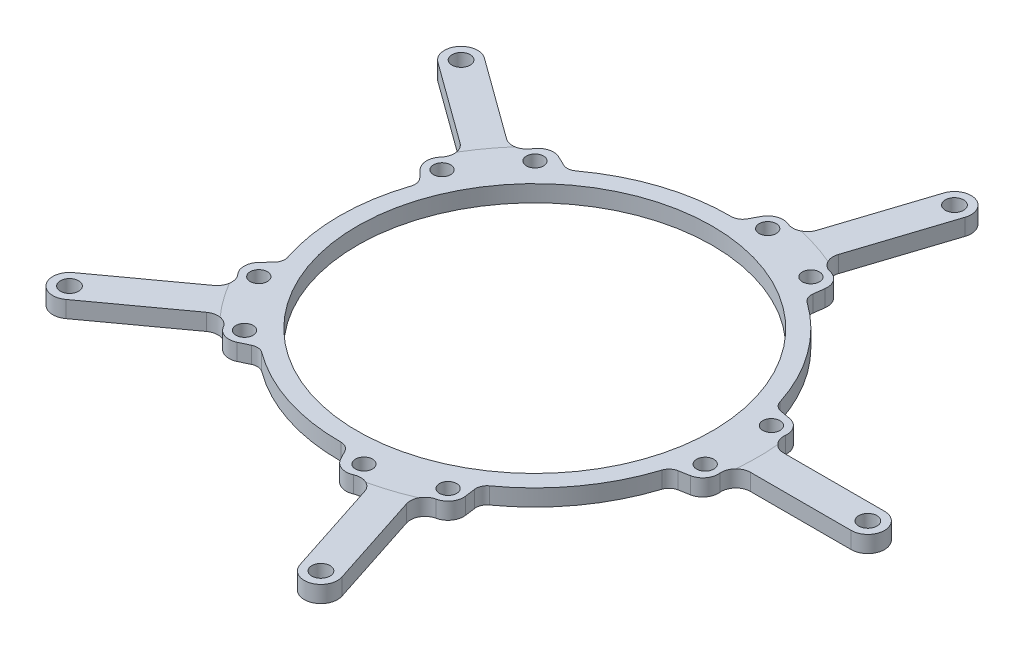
from build123d import *

# Parameters (mm, degrees)
SKETCH11_R                   = 63.8175
SKETCH11_R_2                 = 50.8
BOSS_EXTRUDE3_DEPTH          = 4.7625
BOSS_EXTRUDE4_DEPTH          = 4.7625
FILLET1_R                    = 3.175
F_5_0_2055_DIAMETER_HOLE1_D  = 5.2197
F_10_0_1935_DIAMETER_HOLE1_D = 4.9149
CIRPATTERN1_COUNT            = 5
FILLET1_OF_CIRPATTERN1_R     = 3.175
CUT_EXTRUDE3_REACH           = 140.369
CIRPATTERN2_COUNT            = 5


with BuildPart() as part:
    # Sketch11 → Boss-Extrude3 (new body)
    with BuildSketch(Plane(origin=(0, 0, 0), x_dir=(1, 0, 0), z_dir=(0, 1, 0))):
        with Locations(Location((0, 0, 0), (0, 0, 90))):
            Circle(SKETCH11_R)
        with Locations(Location((0, 0, 0), (0, 0, 90))):
            Circle(SKETCH11_R_2, mode=Mode.SUBTRACT)
    extrude(amount=BOSS_EXTRUDE3_DEPTH)

    # Sketch12 → Boss-Extrude4 (add)
    with BuildSketch(Plane(origin=(0, 0, 0), x_dir=(1, 0, 0), z_dir=(0, 1, 0))):
        with BuildLine():
            Line((95.3262, 4.7625), (63.639546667, 4.7625))
            ThreePointArc((63.639546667, 4.7625), (63.8175, 0), (63.639546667, -4.7625))
            Line((63.639546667, -4.7625), (95.3262, -4.7625))
            ThreePointArc((95.3262, -4.7625), (100.0887, 0), (95.3262, 4.7625))
        make_face()
    boss_extrude4 = extrude(amount=BOSS_EXTRUDE4_DEPTH)

    # Fillet1
    fillet1_edges = [part.edges().sort_by_distance(p)[0] for p in [
        (63.639546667, 2.38125, -4.7625),
        (63.639546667, 2.38125, 4.7625),
    ]]
    fillet(fillet1_edges, radius=FILLET1_R)

    # 5 _0.2055_ Diameter Hole1 (through all)
    with Locations(Plane(origin=(0, 4.7625, 0), x_dir=(1, 0, 0), z_dir=(0, 1, 0))):
        with Locations((95.3262, 0)):
            f_5_0_2055_diameter_hole1 = Hole(F_5_0_2055_DIAMETER_HOLE1_D / 2)

    # 10 _0.1935_ Diameter Hole1 (through all)
    with Locations(Plane(origin=(0, 0, 0), x_dir=(-1, 0, 0), z_dir=(0, -1, 0))):
        with Locations((-58.007419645, -9.232181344), (-57.911217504, 9.817575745)):
            f_10_0_1935_diameter_hole1 = Hole(F_10_0_1935_DIAMETER_HOLE1_D / 2)

    # CirPattern1: Boss-Extrude4, 5 _0.2055_ Diameter Hole1, 10 _0.1935_ Diameter Hole1 ×5 about axis
    cirpattern1_axis = Axis((0, 0, 0), (0, 1, 0))
    add([boss_extrude4.rotate(cirpattern1_axis, i * 360 / CIRPATTERN1_COUNT) for i in range(1, CIRPATTERN1_COUNT)])
    add([f_5_0_2055_diameter_hole1.rotate(cirpattern1_axis, i * 360 / CIRPATTERN1_COUNT) for i in range(1, CIRPATTERN1_COUNT)], mode=Mode.SUBTRACT)
    add([f_10_0_1935_diameter_hole1.rotate(cirpattern1_axis, i * 360 / CIRPATTERN1_COUNT) for i in range(1, CIRPATTERN1_COUNT)], mode=Mode.SUBTRACT)

    # Fillet1 of CirPattern1
    fillet1_of_cirpattern1_edges = [part.edges().sort_by_distance(p)[0] for p in [
        (15.136294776, 2.38125, -61.996498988),
        (24.195108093, 2.38125, -59.053112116),
        (-54.284802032, 2.38125, -33.553443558),
        (-48.686147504, 2.38125, -41.259330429),
        (-48.686147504, 2.38125, 41.259330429),
        (-54.284802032, 2.38125, 33.553443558),
        (24.195108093, 2.38125, 59.053112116),
        (15.136294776, 2.38125, 61.996498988),
    ]]
    fillet(fillet1_of_cirpattern1_edges, radius=FILLET1_OF_CIRPATTERN1_R)

    # Sketch17 → Cut-Extrude3 (cut, up to next)
    with BuildSketch(Plane(origin=(0, 4.7625, 0), x_dir=(1, 0, 0), z_dir=(0, 1, 0)), mode=Mode.PRIVATE) as cut_extrude3_sk1:
        with BuildLine():
            Line((31.638349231, 51.453489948), (31.234531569, 48.435761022))
            ThreePointArc((31.234531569, 48.435761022), (31.467315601, 46.754388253), (32.53301446, 45.433218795))
            ThreePointArc((32.53301446, 45.433218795), (45.207869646, 32.845439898), (53.262813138, 16.90109868))
            ThreePointArc((53.262813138, 16.90109868), (54.190000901, 15.47929502), (55.717147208, 14.738331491))
            Line((55.717147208, 14.738331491), (58.711964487, 14.189855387))
            ThreePointArc((58.711964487, 14.189855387), (61.461379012, 12.4923427), (62.334764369, 9.381389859))
            ThreePointArc((62.334764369, 9.381389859), (63.403901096, 6.144146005), (66.520606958, 4.7625))
            ThreePointArc((66.520606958, 4.7625), (64.412736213, 5.563156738), (63.367971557, 7.561315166))
            ThreePointArc((63.367971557, 7.561315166), (51.629442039, 37.510985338), (26.77301817, 57.929947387))
            ThreePointArc((26.77301817, 57.929947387), (25.195506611, 59.541042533), (25.085404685, 61.793163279))
            ThreePointArc((25.085404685, 61.793163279), (25.436313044, 58.402047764), (28.184733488, 56.384874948))
            ThreePointArc((28.184733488, 56.384874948), (30.873534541, 54.592898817), (31.638349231, 51.453489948))
        make_face()
    cut_extrude3_tool1 = extrude(cut_extrude3_sk1.sketch, amount=-CUT_EXTRUDE3_REACH, mode=Mode.PRIVATE) & part.part
    cut_extrude3 = cut_extrude3_tool1.solids().sort_by_distance((47.310535, 4.7625, -34.373116))[0]
    add(cut_extrude3, mode=Mode.SUBTRACT)

    # CirPattern2: Cut-Extrude3 ×5 about axis
    cirpattern2_axis = Axis((0, 0, 0), (0, 1, 0))
    for i in range(1, CIRPATTERN2_COUNT):
        add(cut_extrude3.rotate(cirpattern2_axis, i * 360 / CIRPATTERN2_COUNT), mode=Mode.SUBTRACT)


solid = part.part
